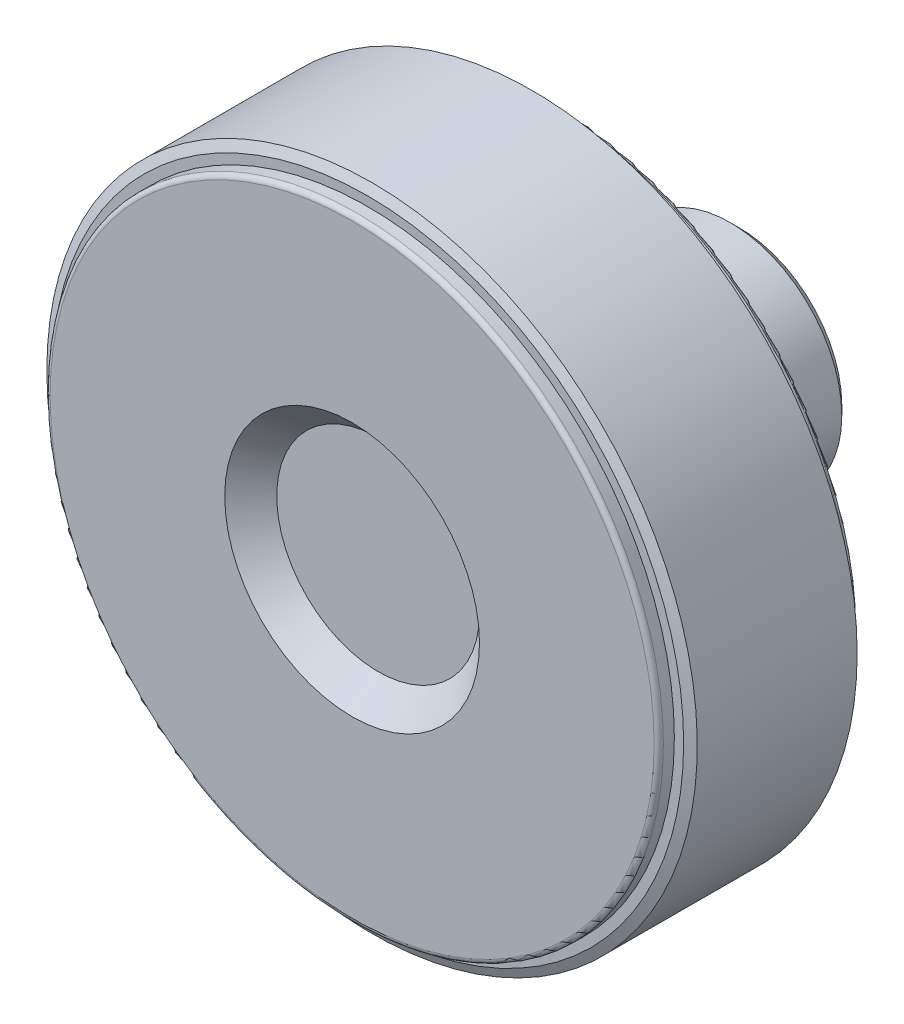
ISO-10303-21;
HEADER;
FILE_DESCRIPTION(('STEP AP214'),'2;1');
FILE_NAME('part.step','',(''),(''),'','','');
FILE_SCHEMA(('AUTOMOTIVE_DESIGN { 1 0 10303 214 1 1 1 1 }'));
ENDSEC;
DATA;
#1=APPLICATION_CONTEXT('core data for automotive mechanical design processes');
#2=APPLICATION_PROTOCOL_DEFINITION('international standard','automotive_design',2000,#1);
#3=PRODUCT_CONTEXT('',#1,'mechanical');
#4=PRODUCT('Part','Part','',(#3));
#5=PRODUCT_RELATED_PRODUCT_CATEGORY('part','',(#4));
#6=PRODUCT_DEFINITION_FORMATION('','',#4);
#7=PRODUCT_DEFINITION_CONTEXT('part definition',#1,'design');
#8=PRODUCT_DEFINITION('design','',#6,#7);
#9=PRODUCT_DEFINITION_SHAPE('','',#8);
#10=(LENGTH_UNIT() NAMED_UNIT(*) SI_UNIT(.MILLI.,.METRE.));
#11=(NAMED_UNIT(*) PLANE_ANGLE_UNIT() SI_UNIT($,.RADIAN.));
#12=(NAMED_UNIT(*) SI_UNIT($,.STERADIAN.) SOLID_ANGLE_UNIT());
#13=UNCERTAINTY_MEASURE_WITH_UNIT(LENGTH_MEASURE(1.E-05),#10,'distance_accuracy_value','');
#14=(GEOMETRIC_REPRESENTATION_CONTEXT(3) GLOBAL_UNCERTAINTY_ASSIGNED_CONTEXT((#13)) GLOBAL_UNIT_ASSIGNED_CONTEXT((#10,
#11,#12)) REPRESENTATION_CONTEXT('',''));
#15=CARTESIAN_POINT('',(0.,0.,0.));
#16=DIRECTION('',(0.,0.,1.));
#17=DIRECTION('',(1.,0.,0.));
#18=AXIS2_PLACEMENT_3D('',#15,#16,#17);
#19=CARTESIAN_POINT('',(0.,4.,0.));
#20=DIRECTION('',(0.,0.,-1.));
#21=DIRECTION('',(-1.,0.,0.));
#22=AXIS2_PLACEMENT_3D('',#19,#20,#21);
#23=PLANE('',#22);
#24=CARTESIAN_POINT('',(0.,0.,0.));
#25=DIRECTION('',(0.,0.,-1.));
#26=DIRECTION('',(-1.,0.,0.));
#27=AXIS2_PLACEMENT_3D('',#24,#25,#26);
#28=CIRCLE('',#27,7.00000000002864);
#29=CARTESIAN_POINT('',(-7.00000000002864,0.,0.));
#30=VERTEX_POINT('',#29);
#31=EDGE_CURVE('E9',#30,#30,#28,.F.);
#32=ORIENTED_EDGE('',*,*,#31,.T.);
#33=EDGE_LOOP('',(#32));
#34=FACE_BOUND('',#33,.T.);
#35=CARTESIAN_POINT('',(0.,0.,0.));
#36=DIRECTION('',(0.,0.,1.));
#37=DIRECTION('',(1.,0.,0.));
#38=AXIS2_PLACEMENT_3D('',#35,#36,#37);
#39=CIRCLE('',#38,8.);
#40=CARTESIAN_POINT('',(8.,0.,0.));
#41=VERTEX_POINT('',#40);
#42=EDGE_CURVE('E211',#41,#41,#39,.T.);
#43=ORIENTED_EDGE('',*,*,#42,.F.);
#44=EDGE_LOOP('',(#43));
#45=FACE_BOUND('',#44,.T.);
#46=ADVANCED_FACE('F14',(#34,#45),#23,.T.);
#47=CARTESIAN_POINT('',(0.,0.,0.15));
#48=DIRECTION('',(0.,0.,1.));
#49=DIRECTION('',(1.,0.,0.));
#50=AXIS2_PLACEMENT_3D('',#47,#48,#49);
#51=CYLINDRICAL_SURFACE('',#50,8.);
#52=ORIENTED_EDGE('',*,*,#42,.T.);
#53=EDGE_LOOP('',(#52));
#54=FACE_BOUND('',#53,.T.);
#55=CARTESIAN_POINT('',(0.,0.,0.3));
#56=DIRECTION('',(0.,0.,1.));
#57=DIRECTION('',(1.,0.,0.));
#58=AXIS2_PLACEMENT_3D('',#55,#56,#57);
#59=CIRCLE('',#58,8.);
#60=CARTESIAN_POINT('',(8.,0.,0.3));
#61=VERTEX_POINT('',#60);
#62=EDGE_CURVE('E208',#61,#61,#59,.T.);
#63=ORIENTED_EDGE('',*,*,#62,.F.);
#64=EDGE_LOOP('',(#63));
#65=FACE_BOUND('',#64,.T.);
#66=ADVANCED_FACE('F410',(#54,#65),#51,.T.);
#67=CARTESIAN_POINT('',(0.,9.5,0.3));
#68=DIRECTION('',(0.,0.,-1.));
#69=DIRECTION('',(-1.,0.,0.));
#70=AXIS2_PLACEMENT_3D('',#67,#68,#69);
#71=PLANE('',#70);
#72=CARTESIAN_POINT('',(0.,0.,0.3));
#73=DIRECTION('',(0.,0.,1.));
#74=DIRECTION('',(1.,0.,0.));
#75=AXIS2_PLACEMENT_3D('',#72,#73,#74);
#76=CIRCLE('',#75,11.);
#77=CARTESIAN_POINT('',(11.,0.,0.3));
#78=VERTEX_POINT('',#77);
#79=EDGE_CURVE('E177',#78,#78,#76,.T.);
#80=ORIENTED_EDGE('',*,*,#79,.F.);
#81=EDGE_LOOP('',(#80));
#82=FACE_BOUND('',#81,.T.);
#83=ORIENTED_EDGE('',*,*,#62,.T.);
#84=EDGE_LOOP('',(#83));
#85=FACE_BOUND('',#84,.T.);
#86=ADVANCED_FACE('F415',(#82,#85),#71,.T.);
#87=CARTESIAN_POINT('',(0.,0.,1.3));
#88=DIRECTION('',(0.,0.,1.));
#89=DIRECTION('',(1.,0.,0.));
#90=AXIS2_PLACEMENT_3D('',#87,#88,#89);
#91=CONICAL_SURFACE('',#90,12.,0.785398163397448);
#92=ORIENTED_EDGE('',*,*,#79,.T.);
#93=EDGE_LOOP('',(#92));
#94=FACE_BOUND('',#93,.T.);
#95=CARTESIAN_POINT('',(0.,0.,1.3));
#96=DIRECTION('',(0.,0.,1.));
#97=DIRECTION('',(1.,0.,0.));
#98=AXIS2_PLACEMENT_3D('',#95,#96,#97);
#99=CIRCLE('',#98,12.);
#100=CARTESIAN_POINT('',(12.,0.,1.3));
#101=VERTEX_POINT('',#100);
#102=EDGE_CURVE('E174',#101,#101,#99,.T.);
#103=ORIENTED_EDGE('',*,*,#102,.F.);
#104=EDGE_LOOP('',(#103));
#105=FACE_BOUND('',#104,.T.);
#106=ADVANCED_FACE('F420',(#94,#105),#91,.T.);
#107=CARTESIAN_POINT('',(0.,0.,17.65));
#108=DIRECTION('',(0.,0.,1.));
#109=DIRECTION('',(1.,0.,0.));
#110=AXIS2_PLACEMENT_3D('',#107,#108,#109);
#111=CYLINDRICAL_SURFACE('',#110,12.);
#112=ORIENTED_EDGE('',*,*,#102,.T.);
#113=EDGE_LOOP('',(#112));
#114=FACE_BOUND('',#113,.T.);
#115=CARTESIAN_POINT('',(0.,0.,34.));
#116=DIRECTION('',(0.,0.,-1.));
#117=DIRECTION('',(-1.,0.,0.));
#118=AXIS2_PLACEMENT_3D('',#115,#116,#117);
#119=CIRCLE('',#118,12.);
#120=CARTESIAN_POINT('',(-12.,0.,34.));
#121=VERTEX_POINT('',#120);
#122=EDGE_CURVE('E77',#121,#121,#119,.T.);
#123=ORIENTED_EDGE('',*,*,#122,.T.);
#124=EDGE_LOOP('',(#123));
#125=FACE_BOUND('',#124,.T.);
#126=ADVANCED_FACE('F427',(#114,#125),#111,.T.);
#127=CARTESIAN_POINT('',(0.,0.,34.));
#128=DIRECTION('',(0.,0.,-1.));
#129=DIRECTION('',(-1.,0.,0.));
#130=AXIS2_PLACEMENT_3D('',#127,#128,#129);
#131=TOROIDAL_SURFACE('',#130,13.,1.);
#132=CARTESIAN_POINT('',(0.,0.,35.));
#133=DIRECTION('',(0.,0.,-1.));
#134=DIRECTION('',(1.,0.,0.));
#135=AXIS2_PLACEMENT_3D('',#132,#133,#134);
#136=CIRCLE('',#135,13.);
#137=CARTESIAN_POINT('',(-13.,0.,35.));
#138=VERTEX_POINT('',#137);
#139=CARTESIAN_POINT('',(13.,0.,35.));
#140=VERTEX_POINT('',#139);
#141=EDGE_CURVE('E70',#138,#140,#136,.F.);
#142=ORIENTED_EDGE('',*,*,#141,.F.);
#143=CARTESIAN_POINT('',(0.,0.,35.));
#144=DIRECTION('',(0.,0.,-1.));
#145=DIRECTION('',(-1.,0.,0.));
#146=AXIS2_PLACEMENT_3D('',#143,#144,#145);
#147=CIRCLE('',#146,13.);
#148=CARTESIAN_POINT('',(0.,13.,35.));
#149=VERTEX_POINT('',#148);
#150=EDGE_CURVE('E73',#149,#138,#147,.F.);
#151=ORIENTED_EDGE('',*,*,#150,.F.);
#152=CARTESIAN_POINT('',(0.,0.,35.));
#153=DIRECTION('',(0.,0.,-1.));
#154=DIRECTION('',(0.,1.,0.));
#155=AXIS2_PLACEMENT_3D('',#152,#153,#154);
#156=CIRCLE('',#155,13.);
#157=EDGE_CURVE('E65',#140,#149,#156,.F.);
#158=ORIENTED_EDGE('',*,*,#157,.F.);
#159=EDGE_LOOP('',(#142,#151,#158));
#160=FACE_BOUND('',#159,.T.);
#161=ORIENTED_EDGE('',*,*,#122,.F.);
#162=EDGE_LOOP('',(#161));
#163=FACE_BOUND('',#162,.T.);
#164=ADVANCED_FACE('F68',(#160,#163),#131,.F.);
#165=CARTESIAN_POINT('',(0.,19.4615384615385,35.));
#166=DIRECTION('',(0.,0.,-1.));
#167=DIRECTION('',(-1.,0.,0.));
#168=AXIS2_PLACEMENT_3D('',#165,#166,#167);
#169=PLANE('',#168);
#170=CARTESIAN_POINT('',(0.,0.,35.));
#171=DIRECTION('',(0.,0.,1.));
#172=DIRECTION('',(-1.,0.,0.));
#173=AXIS2_PLACEMENT_3D('',#170,#171,#172);
#174=CIRCLE('',#173,25.9230769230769);
#175=CARTESIAN_POINT('',(25.9230769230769,0.,35.));
#176=VERTEX_POINT('',#175);
#177=CARTESIAN_POINT('',(-25.9230769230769,0.,35.));
#178=VERTEX_POINT('',#177);
#179=EDGE_CURVE('E83',#176,#178,#174,.F.);
#180=ORIENTED_EDGE('',*,*,#179,.T.);
#181=CARTESIAN_POINT('',(0.,0.,35.));
#182=DIRECTION('',(0.,0.,1.));
#183=DIRECTION('',(0.,1.,0.));
#184=AXIS2_PLACEMENT_3D('',#181,#182,#183);
#185=CIRCLE('',#184,25.9230769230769);
#186=CARTESIAN_POINT('',(0.,25.9230769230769,35.));
#187=VERTEX_POINT('',#186);
#188=EDGE_CURVE('E132',#178,#187,#185,.F.);
#189=ORIENTED_EDGE('',*,*,#188,.T.);
#190=CARTESIAN_POINT('',(0.,0.,35.));
#191=DIRECTION('',(0.,0.,1.));
#192=DIRECTION('',(1.,0.,0.));
#193=AXIS2_PLACEMENT_3D('',#190,#191,#192);
#194=CIRCLE('',#193,25.9230769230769);
#195=EDGE_CURVE('E145',#187,#176,#194,.F.);
#196=ORIENTED_EDGE('',*,*,#195,.T.);
#197=EDGE_LOOP('',(#180,#189,#196));
#198=FACE_BOUND('',#197,.T.);
#199=ORIENTED_EDGE('',*,*,#150,.T.);
#200=ORIENTED_EDGE('',*,*,#141,.T.);
#201=ORIENTED_EDGE('',*,*,#157,.T.);
#202=EDGE_LOOP('',(#199,#200,#201));
#203=FACE_BOUND('',#202,.T.);
#204=ADVANCED_FACE('F81',(#198,#203),#169,.T.);
#205=CARTESIAN_POINT('',(0.,0.,34.));
#206=DIRECTION('',(0.,0.,-1.));
#207=DIRECTION('',(-1.,0.,0.));
#208=AXIS2_PLACEMENT_3D('',#205,#206,#207);
#209=TOROIDAL_SURFACE('',#208,25.9230769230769,1.);
#210=ORIENTED_EDGE('',*,*,#188,.F.);
#211=ORIENTED_EDGE('',*,*,#179,.F.);
#212=ORIENTED_EDGE('',*,*,#195,.F.);
#213=EDGE_LOOP('',(#210,#211,#212));
#214=FACE_BOUND('',#213,.T.);
#215=CARTESIAN_POINT('',(0.,0.,34.));
#216=DIRECTION('',(0.,0.,1.));
#217=DIRECTION('',(1.,0.,0.));
#218=AXIS2_PLACEMENT_3D('',#215,#216,#217);
#219=CIRCLE('',#218,26.9230769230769);
#220=CARTESIAN_POINT('',(26.9230769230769,0.,34.));
#221=VERTEX_POINT('',#220);
#222=EDGE_CURVE('E205',#221,#221,#219,.F.);
#223=ORIENTED_EDGE('',*,*,#222,.T.);
#224=EDGE_LOOP('',(#223));
#225=FACE_BOUND('',#224,.T.);
#226=ADVANCED_FACE('F102',(#214,#225),#209,.F.);
#227=CARTESIAN_POINT('',(0.,0.,27.25));
#228=DIRECTION('',(0.,0.,1.));
#229=DIRECTION('',(1.,0.,0.));
#230=AXIS2_PLACEMENT_3D('',#227,#228,#229);
#231=CYLINDRICAL_SURFACE('',#230,26.9230769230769);
#232=ORIENTED_EDGE('',*,*,#222,.F.);
#233=EDGE_LOOP('',(#232));
#234=FACE_BOUND('',#233,.T.);
#235=CARTESIAN_POINT('',(0.,0.,20.5));
#236=DIRECTION('',(0.,0.,1.));
#237=DIRECTION('',(1.,0.,0.));
#238=AXIS2_PLACEMENT_3D('',#235,#236,#237);
#239=CIRCLE('',#238,26.9230769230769);
#240=CARTESIAN_POINT('',(26.9230769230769,0.,20.5));
#241=VERTEX_POINT('',#240);
#242=EDGE_CURVE('E201',#241,#241,#239,.T.);
#243=ORIENTED_EDGE('',*,*,#242,.F.);
#244=EDGE_LOOP('',(#243));
#245=FACE_BOUND('',#244,.T.);
#246=ADVANCED_FACE('F326',(#234,#245),#231,.F.);
#247=CARTESIAN_POINT('',(0.,29.7115384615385,20.5));
#248=DIRECTION('',(0.,0.,-1.));
#249=DIRECTION('',(-1.,0.,0.));
#250=AXIS2_PLACEMENT_3D('',#247,#248,#249);
#251=PLANE('',#250);
#252=CARTESIAN_POINT('',(0.,0.,20.5));
#253=DIRECTION('',(0.,0.,1.));
#254=DIRECTION('',(-1.,0.,0.));
#255=AXIS2_PLACEMENT_3D('',#252,#253,#254);
#256=CIRCLE('',#255,32.5);
#257=CARTESIAN_POINT('',(-32.5,0.,20.5));
#258=VERTEX_POINT('',#257);
#259=CARTESIAN_POINT('',(32.5,0.,20.5));
#260=VERTEX_POINT('',#259);
#261=EDGE_CURVE('E261',#258,#260,#256,.T.);
#262=ORIENTED_EDGE('',*,*,#261,.F.);
#263=CARTESIAN_POINT('',(0.,0.,20.5));
#264=DIRECTION('',(0.,0.,1.));
#265=DIRECTION('',(0.,1.,0.));
#266=AXIS2_PLACEMENT_3D('',#263,#264,#265);
#267=CIRCLE('',#266,32.5);
#268=CARTESIAN_POINT('',(0.,32.5,20.5));
#269=VERTEX_POINT('',#268);
#270=EDGE_CURVE('E296',#269,#258,#267,.T.);
#271=ORIENTED_EDGE('',*,*,#270,.F.);
#272=CARTESIAN_POINT('',(0.,0.,20.5));
#273=DIRECTION('',(0.,0.,1.));
#274=DIRECTION('',(1.,0.,0.));
#275=AXIS2_PLACEMENT_3D('',#272,#273,#274);
#276=CIRCLE('',#275,32.5);
#277=EDGE_CURVE('E204',#260,#269,#276,.T.);
#278=ORIENTED_EDGE('',*,*,#277,.F.);
#279=EDGE_LOOP('',(#262,#271,#278));
#280=FACE_BOUND('',#279,.T.);
#281=ORIENTED_EDGE('',*,*,#242,.T.);
#282=EDGE_LOOP('',(#281));
#283=FACE_BOUND('',#282,.T.);
#284=ADVANCED_FACE('F272',(#280,#283),#251,.T.);
#285=CARTESIAN_POINT('',(0.,0.,21.));
#286=DIRECTION('',(0.,0.,-1.));
#287=DIRECTION('',(-1.,0.,0.));
#288=AXIS2_PLACEMENT_3D('',#285,#286,#287);
#289=TOROIDAL_SURFACE('',#288,32.5,0.5);
#290=ORIENTED_EDGE('',*,*,#270,.T.);
#291=ORIENTED_EDGE('',*,*,#261,.T.);
#292=ORIENTED_EDGE('',*,*,#277,.T.);
#293=EDGE_LOOP('',(#290,#291,#292));
#294=FACE_BOUND('',#293,.T.);
#295=CARTESIAN_POINT('',(0.,0.,21.));
#296=DIRECTION('',(0.,0.,1.));
#297=DIRECTION('',(1.,0.,0.));
#298=AXIS2_PLACEMENT_3D('',#295,#296,#297);
#299=CIRCLE('',#298,33.);
#300=CARTESIAN_POINT('',(33.,0.,21.));
#301=VERTEX_POINT('',#300);
#302=EDGE_CURVE('E200',#301,#301,#299,.T.);
#303=ORIENTED_EDGE('',*,*,#302,.F.);
#304=EDGE_LOOP('',(#303));
#305=FACE_BOUND('',#304,.T.);
#306=ADVANCED_FACE('F266',(#294,#305),#289,.T.);
#307=CARTESIAN_POINT('',(0.,0.,21.59));
#308=DIRECTION('',(0.,0.,1.));
#309=DIRECTION('',(1.,0.,0.));
#310=AXIS2_PLACEMENT_3D('',#307,#308,#309);
#311=CYLINDRICAL_SURFACE('',#310,33.);
#312=ORIENTED_EDGE('',*,*,#302,.T.);
#313=EDGE_LOOP('',(#312));
#314=FACE_BOUND('',#313,.T.);
#315=CARTESIAN_POINT('',(0.,0.,22.18));
#316=DIRECTION('',(0.,0.,1.));
#317=DIRECTION('',(1.,0.,0.));
#318=AXIS2_PLACEMENT_3D('',#315,#316,#317);
#319=CIRCLE('',#318,33.);
#320=CARTESIAN_POINT('',(33.,0.,22.18));
#321=VERTEX_POINT('',#320);
#322=EDGE_CURVE('E197',#321,#321,#319,.T.);
#323=ORIENTED_EDGE('',*,*,#322,.F.);
#324=EDGE_LOOP('',(#323));
#325=FACE_BOUND('',#324,.T.);
#326=ADVANCED_FACE('F271',(#314,#325),#311,.T.);
#327=CARTESIAN_POINT('',(0.,33.5,22.18));
#328=DIRECTION('',(0.,0.,-1.));
#329=DIRECTION('',(-1.,0.,0.));
#330=AXIS2_PLACEMENT_3D('',#327,#328,#329);
#331=PLANE('',#330);
#332=CARTESIAN_POINT('',(0.,0.,22.18));
#333=DIRECTION('',(0.,0.,1.));
#334=DIRECTION('',(1.,0.,0.));
#335=AXIS2_PLACEMENT_3D('',#332,#333,#334);
#336=CIRCLE('',#335,34.);
#337=CARTESIAN_POINT('',(34.,0.,22.18));
#338=VERTEX_POINT('',#337);
#339=EDGE_CURVE('E193',#338,#338,#336,.T.);
#340=ORIENTED_EDGE('',*,*,#339,.F.);
#341=EDGE_LOOP('',(#340));
#342=FACE_BOUND('',#341,.T.);
#343=ORIENTED_EDGE('',*,*,#322,.T.);
#344=EDGE_LOOP('',(#343));
#345=FACE_BOUND('',#344,.T.);
#346=ADVANCED_FACE('F340',(#342,#345),#331,.T.);
#347=CARTESIAN_POINT('',(0.,0.,22.646307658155));
#348=DIRECTION('',(0.,0.,1.));
#349=DIRECTION('',(1.,0.,0.));
#350=AXIS2_PLACEMENT_3D('',#347,#348,#349);
#351=CONICAL_SURFACE('',#350,35.,1.13446401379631);
#352=CARTESIAN_POINT('',(0.,2.67164068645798E-12,22.646307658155));
#353=DIRECTION('',(0.,0.,-1.));
#354=DIRECTION('',(-1.,0.,0.));
#355=AXIS2_PLACEMENT_3D('',#352,#353,#354);
#356=CIRCLE('',#355,34.9999999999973);
#357=CARTESIAN_POINT('',(-34.9999999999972,2.67164068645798E-12,22.646307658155));
#358=VERTEX_POINT('',#357);
#359=EDGE_CURVE('E196',#358,#358,#356,.F.);
#360=ORIENTED_EDGE('',*,*,#359,.F.);
#361=EDGE_LOOP('',(#360));
#362=FACE_BOUND('',#361,.T.);
#363=ORIENTED_EDGE('',*,*,#339,.T.);
#364=EDGE_LOOP('',(#363));
#365=FACE_BOUND('',#364,.T.);
#366=ADVANCED_FACE('F337',(#362,#365),#351,.T.);
#367=CARTESIAN_POINT('',(0.,0.,20.));
#368=DIRECTION('',(0.,0.,-1.));
#369=DIRECTION('',(-1.,0.,0.));
#370=AXIS2_PLACEMENT_3D('',#367,#368,#369);
#371=PLANE('',#370);
#372=CARTESIAN_POINT('',(0.,0.,20.));
#373=DIRECTION('',(0.,0.,-1.));
#374=DIRECTION('',(-1.,0.,0.));
#375=AXIS2_PLACEMENT_3D('',#372,#373,#374);
#376=CIRCLE('',#375,6.00000000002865);
#377=CARTESIAN_POINT('',(-6.00000000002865,0.,20.));
#378=VERTEX_POINT('',#377);
#379=EDGE_CURVE('E214',#378,#378,#376,.T.);
#380=ORIENTED_EDGE('',*,*,#379,.T.);
#381=EDGE_LOOP('',(#380));
#382=FACE_BOUND('',#381,.T.);
#383=ADVANCED_FACE('F339',(#382),#371,.T.);
#384=CARTESIAN_POINT('',(0.,0.,20.));
#385=DIRECTION('',(0.,0.,-1.));
#386=DIRECTION('',(-1.,0.,0.));
#387=AXIS2_PLACEMENT_3D('',#384,#385,#386);
#388=CYLINDRICAL_SURFACE('',#387,6.00000000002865);
#389=CARTESIAN_POINT('',(0.,0.,0.99999999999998));
#390=DIRECTION('',(0.,0.,-1.));
#391=DIRECTION('',(-1.,0.,0.));
#392=AXIS2_PLACEMENT_3D('',#389,#390,#391);
#393=CIRCLE('',#392,6.00000000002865);
#394=CARTESIAN_POINT('',(-6.00000000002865,0.,0.99999999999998));
#395=VERTEX_POINT('',#394);
#396=EDGE_CURVE('E24',#395,#395,#393,.T.);
#397=ORIENTED_EDGE('',*,*,#396,.T.);
#398=EDGE_LOOP('',(#397));
#399=FACE_BOUND('',#398,.T.);
#400=ORIENTED_EDGE('',*,*,#379,.F.);
#401=EDGE_LOOP('',(#400));
#402=FACE_BOUND('',#401,.T.);
#403=ADVANCED_FACE('F348',(#399,#402),#388,.F.);
#404=CARTESIAN_POINT('',(0.,0.,0.99999999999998));
#405=DIRECTION('',(0.,0.,-1.));
#406=DIRECTION('',(-1.,0.,0.));
#407=AXIS2_PLACEMENT_3D('',#404,#405,#406);
#408=CONICAL_SURFACE('',#407,6.00000000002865,0.785398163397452);
#409=ORIENTED_EDGE('',*,*,#31,.F.);
#410=EDGE_LOOP('',(#409));
#411=FACE_BOUND('',#410,.T.);
#412=ORIENTED_EDGE('',*,*,#396,.F.);
#413=EDGE_LOOP('',(#412));
#414=FACE_BOUND('',#413,.T.);
#415=ADVANCED_FACE('F16',(#411,#414),#408,.F.);
#416=CARTESIAN_POINT('',(0.,5.45454545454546,39.2));
#417=DIRECTION('',(0.,0.,1.));
#418=DIRECTION('',(1.,0.,0.));
#419=AXIS2_PLACEMENT_3D('',#416,#417,#418);
#420=PLANE('',#419);
#421=CARTESIAN_POINT('',(0.,0.,39.2));
#422=DIRECTION('',(0.,0.,1.));
#423=DIRECTION('',(1.,0.,0.));
#424=AXIS2_PLACEMENT_3D('',#421,#422,#423);
#425=CIRCLE('',#424,10.9090909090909);
#426=CARTESIAN_POINT('',(10.9090909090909,0.,39.2));
#427=VERTEX_POINT('',#426);
#428=EDGE_CURVE('E181',#427,#427,#425,.T.);
#429=ORIENTED_EDGE('',*,*,#428,.T.);
#430=EDGE_LOOP('',(#429));
#431=FACE_BOUND('',#430,.T.);
#432=ADVANCED_FACE('F239',(#431),#420,.T.);
#433=CARTESIAN_POINT('',(0.,0.,42.));
#434=DIRECTION('',(0.,0.,1.));
#435=DIRECTION('',(1.,0.,0.));
#436=AXIS2_PLACEMENT_3D('',#433,#434,#435);
#437=CONICAL_SURFACE('',#436,13.7090909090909,0.785398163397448);
#438=CARTESIAN_POINT('',(0.,0.,42.));
#439=DIRECTION('',(0.,0.,1.));
#440=DIRECTION('',(1.,0.,0.));
#441=AXIS2_PLACEMENT_3D('',#438,#439,#440);
#442=CIRCLE('',#441,13.7090909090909);
#443=CARTESIAN_POINT('',(13.7090909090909,0.,42.));
#444=VERTEX_POINT('',#443);
#445=EDGE_CURVE('E178',#444,#444,#442,.F.);
#446=ORIENTED_EDGE('',*,*,#445,.F.);
#447=EDGE_LOOP('',(#446));
#448=FACE_BOUND('',#447,.T.);
#449=ORIENTED_EDGE('',*,*,#428,.F.);
#450=EDGE_LOOP('',(#449));
#451=FACE_BOUND('',#450,.T.);
#452=ADVANCED_FACE('F237',(#448,#451),#437,.F.);
#453=CARTESIAN_POINT('',(0.,23.1045454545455,42.));
#454=DIRECTION('',(0.,0.,1.));
#455=DIRECTION('',(1.,0.,0.));
#456=AXIS2_PLACEMENT_3D('',#453,#454,#455);
#457=PLANE('',#456);
#458=ORIENTED_EDGE('',*,*,#445,.T.);
#459=EDGE_LOOP('',(#458));
#460=FACE_BOUND('',#459,.T.);
#461=CARTESIAN_POINT('',(0.,0.,42.));
#462=DIRECTION('',(0.,0.,-1.));
#463=DIRECTION('',(-1.,0.,0.));
#464=AXIS2_PLACEMENT_3D('',#461,#462,#463);
#465=CIRCLE('',#464,32.5);
#466=CARTESIAN_POINT('',(0.,32.5,42.));
#467=VERTEX_POINT('',#466);
#468=CARTESIAN_POINT('',(-32.5,0.,42.));
#469=VERTEX_POINT('',#468);
#470=EDGE_CURVE('E216',#467,#469,#465,.F.);
#471=ORIENTED_EDGE('',*,*,#470,.T.);
#472=CARTESIAN_POINT('',(0.,0.,42.));
#473=DIRECTION('',(0.,0.,-1.));
#474=DIRECTION('',(1.,0.,0.));
#475=AXIS2_PLACEMENT_3D('',#472,#473,#474);
#476=CIRCLE('',#475,32.5);
#477=CARTESIAN_POINT('',(32.5,0.,42.));
#478=VERTEX_POINT('',#477);
#479=EDGE_CURVE('E33',#469,#478,#476,.F.);
#480=ORIENTED_EDGE('',*,*,#479,.T.);
#481=CARTESIAN_POINT('',(0.,0.,42.));
#482=DIRECTION('',(0.,0.,-1.));
#483=DIRECTION('',(0.,1.,0.));
#484=AXIS2_PLACEMENT_3D('',#481,#482,#483);
#485=CIRCLE('',#484,32.5);
#486=EDGE_CURVE('E184',#478,#467,#485,.F.);
#487=ORIENTED_EDGE('',*,*,#486,.T.);
#488=EDGE_LOOP('',(#471,#480,#487));
#489=FACE_BOUND('',#488,.T.);
#490=ADVANCED_FACE('F235',(#460,#489),#457,.T.);
#491=CARTESIAN_POINT('',(0.,0.,41.5));
#492=DIRECTION('',(0.,0.,-1.));
#493=DIRECTION('',(-1.,0.,0.));
#494=AXIS2_PLACEMENT_3D('',#491,#492,#493);
#495=TOROIDAL_SURFACE('',#494,32.5,0.499999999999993);
#496=CARTESIAN_POINT('',(0.,0.,41.5));
#497=DIRECTION('',(0.,0.,-1.));
#498=DIRECTION('',(-1.,0.,0.));
#499=AXIS2_PLACEMENT_3D('',#496,#497,#498);
#500=CIRCLE('',#499,33.);
#501=CARTESIAN_POINT('',(-33.,0.,41.5));
#502=VERTEX_POINT('',#501);
#503=EDGE_CURVE('E185',#502,#502,#500,.F.);
#504=ORIENTED_EDGE('',*,*,#503,.T.);
#505=EDGE_LOOP('',(#504));
#506=FACE_BOUND('',#505,.T.);
#507=ORIENTED_EDGE('',*,*,#479,.F.);
#508=ORIENTED_EDGE('',*,*,#470,.F.);
#509=ORIENTED_EDGE('',*,*,#486,.F.);
#510=EDGE_LOOP('',(#507,#508,#509));
#511=FACE_BOUND('',#510,.T.);
#512=ADVANCED_FACE('F223',(#506,#511),#495,.T.);
#513=CARTESIAN_POINT('',(0.,0.,40.91));
#514=DIRECTION('',(0.,0.,1.));
#515=DIRECTION('',(1.,0.,0.));
#516=AXIS2_PLACEMENT_3D('',#513,#514,#515);
#517=CYLINDRICAL_SURFACE('',#516,33.);
#518=ORIENTED_EDGE('',*,*,#503,.F.);
#519=EDGE_LOOP('',(#518));
#520=FACE_BOUND('',#519,.T.);
#521=CARTESIAN_POINT('',(0.,0.,40.32));
#522=DIRECTION('',(0.,0.,1.));
#523=DIRECTION('',(1.,0.,0.));
#524=AXIS2_PLACEMENT_3D('',#521,#522,#523);
#525=CIRCLE('',#524,33.);
#526=CARTESIAN_POINT('',(33.,0.,40.32));
#527=VERTEX_POINT('',#526);
#528=EDGE_CURVE('E186',#527,#527,#525,.T.);
#529=ORIENTED_EDGE('',*,*,#528,.T.);
#530=EDGE_LOOP('',(#529));
#531=FACE_BOUND('',#530,.T.);
#532=ADVANCED_FACE('F234',(#520,#531),#517,.T.);
#533=CARTESIAN_POINT('',(0.,0.,39.853692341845));
#534=DIRECTION('',(0.,0.,-1.));
#535=DIRECTION('',(-1.,0.,0.));
#536=AXIS2_PLACEMENT_3D('',#533,#534,#535);
#537=CONICAL_SURFACE('',#536,35.,1.13446401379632);
#538=CARTESIAN_POINT('',(0.,0.,40.32));
#539=DIRECTION('',(0.,0.,-1.));
#540=DIRECTION('',(-1.,0.,0.));
#541=AXIS2_PLACEMENT_3D('',#538,#539,#540);
#542=CIRCLE('',#541,34.);
#543=CARTESIAN_POINT('',(-34.,0.,40.32));
#544=VERTEX_POINT('',#543);
#545=EDGE_CURVE('E189',#544,#544,#542,.F.);
#546=ORIENTED_EDGE('',*,*,#545,.F.);
#547=EDGE_LOOP('',(#546));
#548=FACE_BOUND('',#547,.T.);
#549=CARTESIAN_POINT('',(0.,0.,39.853692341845));
#550=DIRECTION('',(0.,0.,-1.));
#551=DIRECTION('',(0.,1.,0.));
#552=AXIS2_PLACEMENT_3D('',#549,#550,#551);
#553=CIRCLE('',#552,35.);
#554=CARTESIAN_POINT('',(0.,35.,39.853692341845));
#555=VERTEX_POINT('',#554);
#556=EDGE_CURVE('E192',#555,#555,#553,.F.);
#557=ORIENTED_EDGE('',*,*,#556,.T.);
#558=EDGE_LOOP('',(#557));
#559=FACE_BOUND('',#558,.T.);
#560=ADVANCED_FACE('F360',(#548,#559),#537,.T.);
#561=CARTESIAN_POINT('',(0.,33.5,40.32));
#562=DIRECTION('',(0.,0.,1.));
#563=DIRECTION('',(1.,0.,0.));
#564=AXIS2_PLACEMENT_3D('',#561,#562,#563);
#565=PLANE('',#564);
#566=ORIENTED_EDGE('',*,*,#528,.F.);
#567=EDGE_LOOP('',(#566));
#568=FACE_BOUND('',#567,.T.);
#569=ORIENTED_EDGE('',*,*,#545,.T.);
#570=EDGE_LOOP('',(#569));
#571=FACE_BOUND('',#570,.T.);
#572=ADVANCED_FACE('F358',(#568,#571),#565,.T.);
#573=CARTESIAN_POINT('',(0.,2.67164068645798E-12,0.));
#574=DIRECTION('',(0.,0.,-1.));
#575=DIRECTION('',(-1.,0.,0.));
#576=AXIS2_PLACEMENT_3D('',#573,#574,#575);
#577=CYLINDRICAL_SURFACE('',#576,34.9999999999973);
#578=ORIENTED_EDGE('',*,*,#359,.T.);
#579=EDGE_LOOP('',(#578));
#580=FACE_BOUND('',#579,.T.);
#581=ORIENTED_EDGE('',*,*,#556,.F.);
#582=EDGE_LOOP('',(#581));
#583=FACE_BOUND('',#582,.T.);
#584=ADVANCED_FACE('F355',(#580,#583),#577,.T.);
#585=CLOSED_SHELL('',(#46,#66,#86,#106,#126,#164,#204,#226,#246,#284,#306,#326,#346,#366,#383,
#403,#415,#432,#452,#490,#512,#532,#560,#572,#584));
#586=MANIFOLD_SOLID_BREP('B1',#585);
#587=ADVANCED_BREP_SHAPE_REPRESENTATION('',(#18,#586),#14);
#588=SHAPE_DEFINITION_REPRESENTATION(#9,#587);
ENDSEC;
END-ISO-10303-21;
